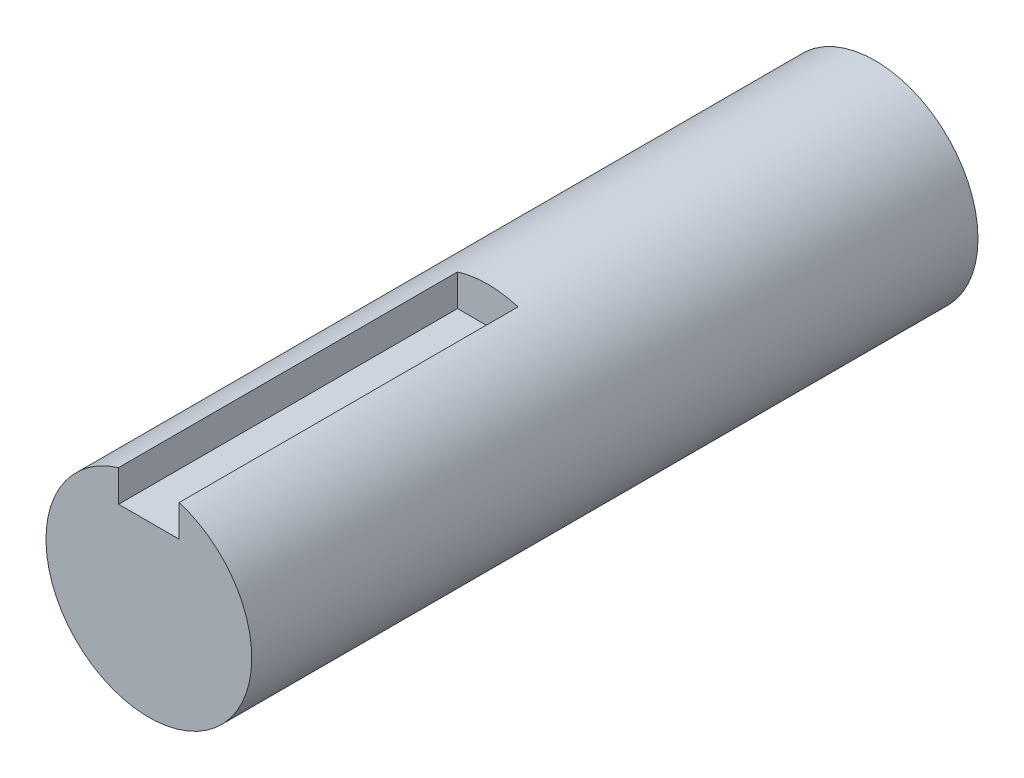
ISO-10303-21;
HEADER;
FILE_DESCRIPTION(('STEP AP214'),'2;1');
FILE_NAME('part.step','',(''),(''),'','','');
FILE_SCHEMA(('AUTOMOTIVE_DESIGN { 1 0 10303 214 1 1 1 1 }'));
ENDSEC;
DATA;
#1=APPLICATION_CONTEXT('core data for automotive mechanical design processes');
#2=APPLICATION_PROTOCOL_DEFINITION('international standard','automotive_design',2000,#1);
#3=PRODUCT_CONTEXT('',#1,'mechanical');
#4=PRODUCT('Part','Part','',(#3));
#5=PRODUCT_RELATED_PRODUCT_CATEGORY('part','',(#4));
#6=PRODUCT_DEFINITION_FORMATION('','',#4);
#7=PRODUCT_DEFINITION_CONTEXT('part definition',#1,'design');
#8=PRODUCT_DEFINITION('design','',#6,#7);
#9=PRODUCT_DEFINITION_SHAPE('','',#8);
#10=(LENGTH_UNIT() NAMED_UNIT(*) SI_UNIT(.MILLI.,.METRE.));
#11=(NAMED_UNIT(*) PLANE_ANGLE_UNIT() SI_UNIT($,.RADIAN.));
#12=(NAMED_UNIT(*) SI_UNIT($,.STERADIAN.) SOLID_ANGLE_UNIT());
#13=UNCERTAINTY_MEASURE_WITH_UNIT(LENGTH_MEASURE(1.E-05),#10,'distance_accuracy_value','');
#14=(GEOMETRIC_REPRESENTATION_CONTEXT(3) GLOBAL_UNCERTAINTY_ASSIGNED_CONTEXT((#13)) GLOBAL_UNIT_ASSIGNED_CONTEXT((#10,
#11,#12)) REPRESENTATION_CONTEXT('',''));
#15=CARTESIAN_POINT('',(0.,0.,0.));
#16=DIRECTION('',(0.,0.,1.));
#17=DIRECTION('',(1.,0.,0.));
#18=AXIS2_PLACEMENT_3D('',#15,#16,#17);
#19=CARTESIAN_POINT('',(0.,0.,-60.));
#20=DIRECTION('',(0.,0.,1.));
#21=DIRECTION('',(1.,0.,0.));
#22=AXIS2_PLACEMENT_3D('',#19,#20,#21);
#23=CYLINDRICAL_SURFACE('',#22,8.5);
#24=CARTESIAN_POINT('',(0.,0.,-60.));
#25=DIRECTION('',(0.,0.,1.));
#26=DIRECTION('',(1.,0.,0.));
#27=AXIS2_PLACEMENT_3D('',#24,#25,#26);
#28=CIRCLE('',#27,8.5);
#29=CARTESIAN_POINT('',(8.5,0.,-60.));
#30=VERTEX_POINT('',#29);
#31=EDGE_CURVE('E102',#30,#30,#28,.T.);
#32=ORIENTED_EDGE('',*,*,#31,.T.);
#33=EDGE_LOOP('',(#32));
#34=FACE_BOUND('',#33,.T.);
#35=CARTESIAN_POINT('',(0.,0.,0.));
#36=DIRECTION('',(0.,0.,1.));
#37=DIRECTION('',(1.,0.,0.));
#38=AXIS2_PLACEMENT_3D('',#35,#36,#37);
#39=CIRCLE('',#38,8.5);
#40=CARTESIAN_POINT('',(-2.5,8.12403840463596,0.));
#41=VERTEX_POINT('',#40);
#42=CARTESIAN_POINT('',(2.5,8.12403840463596,0.));
#43=VERTEX_POINT('',#42);
#44=EDGE_CURVE('E99',#41,#43,#39,.T.);
#45=ORIENTED_EDGE('',*,*,#44,.F.);
#46=DIRECTION('',(0.,0.,1.));
#47=VECTOR('',#46,1.);
#48=CARTESIAN_POINT('',(-2.5,8.12403840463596,-60.));
#49=LINE('',#48,#47);
#50=CARTESIAN_POINT('',(-2.5,8.12403840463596,-28.));
#51=VERTEX_POINT('',#50);
#52=EDGE_CURVE('E96',#41,#51,#49,.F.);
#53=ORIENTED_EDGE('',*,*,#52,.T.);
#54=CARTESIAN_POINT('',(0.,0.,-28.));
#55=DIRECTION('',(0.,0.,-1.));
#56=DIRECTION('',(-1.,0.,0.));
#57=AXIS2_PLACEMENT_3D('',#54,#55,#56);
#58=CIRCLE('',#57,8.5);
#59=CARTESIAN_POINT('',(2.5,8.12403840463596,-28.));
#60=VERTEX_POINT('',#59);
#61=EDGE_CURVE('E11',#60,#51,#58,.F.);
#62=ORIENTED_EDGE('',*,*,#61,.F.);
#63=DIRECTION('',(0.,0.,1.));
#64=VECTOR('',#63,1.);
#65=CARTESIAN_POINT('',(2.5,8.12403840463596,-60.));
#66=LINE('',#65,#64);
#67=EDGE_CURVE('E84',#43,#60,#66,.F.);
#68=ORIENTED_EDGE('',*,*,#67,.F.);
#69=EDGE_LOOP('',(#45,#53,#62,#68));
#70=FACE_BOUND('',#69,.T.);
#71=ADVANCED_FACE('F35',(#34,#70),#23,.T.);
#72=CARTESIAN_POINT('',(0.,0.,0.));
#73=DIRECTION('',(0.,0.,1.));
#74=DIRECTION('',(1.,0.,0.));
#75=AXIS2_PLACEMENT_3D('',#72,#73,#74);
#76=PLANE('',#75);
#77=DIRECTION('',(1.,0.,0.));
#78=VECTOR('',#77,1.);
#79=CARTESIAN_POINT('',(-2.5,5.5,0.));
#80=LINE('',#79,#78);
#81=CARTESIAN_POINT('',(-2.5,5.5,0.));
#82=VERTEX_POINT('',#81);
#83=CARTESIAN_POINT('',(2.5,5.5,0.));
#84=VERTEX_POINT('',#83);
#85=EDGE_CURVE('E80',#82,#84,#80,.T.);
#86=ORIENTED_EDGE('',*,*,#85,.F.);
#87=DIRECTION('',(0.,1.,0.));
#88=VECTOR('',#87,1.);
#89=CARTESIAN_POINT('',(-2.5,0.,0.));
#90=LINE('',#89,#88);
#91=EDGE_CURVE('E42',#82,#41,#90,.T.);
#92=ORIENTED_EDGE('',*,*,#91,.T.);
#93=ORIENTED_EDGE('',*,*,#44,.T.);
#94=DIRECTION('',(0.,1.,0.));
#95=VECTOR('',#94,1.);
#96=CARTESIAN_POINT('',(2.5,0.,0.));
#97=LINE('',#96,#95);
#98=EDGE_CURVE('E105',#84,#43,#97,.T.);
#99=ORIENTED_EDGE('',*,*,#98,.F.);
#100=EDGE_LOOP('',(#86,#92,#93,#99));
#101=FACE_BOUND('',#100,.T.);
#102=ADVANCED_FACE('F109',(#101),#76,.T.);
#103=CARTESIAN_POINT('',(0.,0.,-60.));
#104=DIRECTION('',(0.,0.,1.));
#105=DIRECTION('',(1.,0.,0.));
#106=AXIS2_PLACEMENT_3D('',#103,#104,#105);
#107=PLANE('',#106);
#108=ORIENTED_EDGE('',*,*,#31,.F.);
#109=EDGE_LOOP('',(#108));
#110=FACE_BOUND('',#109,.T.);
#111=ADVANCED_FACE('F126',(#110),#107,.F.);
#112=CARTESIAN_POINT('',(-2.5,5.5,0.));
#113=DIRECTION('',(0.,-1.,0.));
#114=DIRECTION('',(0.,0.,-1.));
#115=AXIS2_PLACEMENT_3D('',#112,#113,#114);
#116=PLANE('',#115);
#117=DIRECTION('',(1.,0.,0.));
#118=VECTOR('',#117,1.);
#119=CARTESIAN_POINT('',(-2.5,5.5,-28.));
#120=LINE('',#119,#118);
#121=CARTESIAN_POINT('',(-2.5,5.5,-28.));
#122=VERTEX_POINT('',#121);
#123=CARTESIAN_POINT('',(2.5,5.5,-28.));
#124=VERTEX_POINT('',#123);
#125=EDGE_CURVE('E73',#122,#124,#120,.T.);
#126=ORIENTED_EDGE('',*,*,#125,.F.);
#127=DIRECTION('',(0.,0.,-1.));
#128=VECTOR('',#127,1.);
#129=CARTESIAN_POINT('',(-2.5,5.5,0.));
#130=LINE('',#129,#128);
#131=EDGE_CURVE('E85',#82,#122,#130,.T.);
#132=ORIENTED_EDGE('',*,*,#131,.F.);
#133=ORIENTED_EDGE('',*,*,#85,.T.);
#134=DIRECTION('',(0.,0.,-1.));
#135=VECTOR('',#134,1.);
#136=CARTESIAN_POINT('',(2.5,5.5,0.));
#137=LINE('',#136,#135);
#138=EDGE_CURVE('E49',#84,#124,#137,.T.);
#139=ORIENTED_EDGE('',*,*,#138,.T.);
#140=EDGE_LOOP('',(#126,#132,#133,#139));
#141=FACE_BOUND('',#140,.T.);
#142=ADVANCED_FACE('F87',(#141),#116,.F.);
#143=CARTESIAN_POINT('',(-2.5,5.5,-28.));
#144=DIRECTION('',(0.,0.,-1.));
#145=DIRECTION('',(-1.,0.,0.));
#146=AXIS2_PLACEMENT_3D('',#143,#144,#145);
#147=PLANE('',#146);
#148=ORIENTED_EDGE('',*,*,#61,.T.);
#149=DIRECTION('',(0.,1.,0.));
#150=VECTOR('',#149,1.);
#151=CARTESIAN_POINT('',(-2.5,5.5,-28.));
#152=LINE('',#151,#150);
#153=EDGE_CURVE('E76',#122,#51,#152,.T.);
#154=ORIENTED_EDGE('',*,*,#153,.F.);
#155=ORIENTED_EDGE('',*,*,#125,.T.);
#156=DIRECTION('',(0.,1.,0.));
#157=VECTOR('',#156,1.);
#158=CARTESIAN_POINT('',(2.5,5.5,-28.));
#159=LINE('',#158,#157);
#160=EDGE_CURVE('E75',#124,#60,#159,.T.);
#161=ORIENTED_EDGE('',*,*,#160,.T.);
#162=EDGE_LOOP('',(#148,#154,#155,#161));
#163=FACE_BOUND('',#162,.T.);
#164=ADVANCED_FACE('F74',(#163),#147,.F.);
#165=CARTESIAN_POINT('',(-2.5,5.5,-28.));
#166=DIRECTION('',(1.,0.,0.));
#167=DIRECTION('',(0.,0.,-1.));
#168=AXIS2_PLACEMENT_3D('',#165,#166,#167);
#169=PLANE('',#168);
#170=ORIENTED_EDGE('',*,*,#91,.F.);
#171=ORIENTED_EDGE('',*,*,#131,.T.);
#172=ORIENTED_EDGE('',*,*,#153,.T.);
#173=ORIENTED_EDGE('',*,*,#52,.F.);
#174=EDGE_LOOP('',(#170,#171,#172,#173));
#175=FACE_BOUND('',#174,.T.);
#176=ADVANCED_FACE('F112',(#175),#169,.T.);
#177=CARTESIAN_POINT('',(2.5,5.5,-28.));
#178=DIRECTION('',(1.,0.,0.));
#179=DIRECTION('',(0.,0.,-1.));
#180=AXIS2_PLACEMENT_3D('',#177,#178,#179);
#181=PLANE('',#180);
#182=ORIENTED_EDGE('',*,*,#67,.T.);
#183=ORIENTED_EDGE('',*,*,#160,.F.);
#184=ORIENTED_EDGE('',*,*,#138,.F.);
#185=ORIENTED_EDGE('',*,*,#98,.T.);
#186=EDGE_LOOP('',(#182,#183,#184,#185));
#187=FACE_BOUND('',#186,.T.);
#188=ADVANCED_FACE('F82',(#187),#181,.F.);
#189=CLOSED_SHELL('',(#71,#102,#111,#142,#164,#176,#188));
#190=MANIFOLD_SOLID_BREP('B2',#189);
#191=ADVANCED_BREP_SHAPE_REPRESENTATION('',(#18,#190),#14);
#192=SHAPE_DEFINITION_REPRESENTATION(#9,#191);
ENDSEC;
END-ISO-10303-21;
